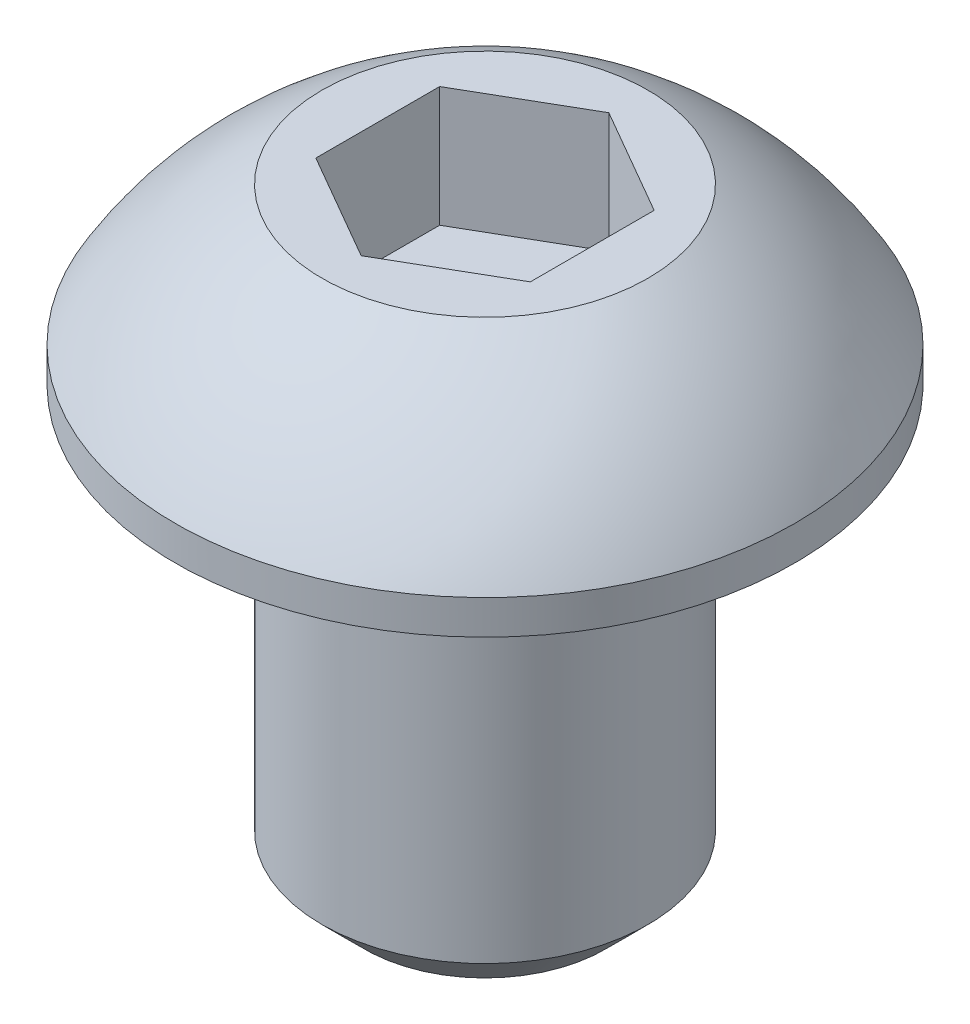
from build123d import *

# Parameters (mm, degrees)
CUT_EXTRUDE1_DEPTH = 1.778


with BuildPart() as part:
    # Sketch1 → Base-Revolve (revolve)
    with BuildSketch(Plane.XY, mode=Mode.PRIVATE) as base_revolve_sk:
        with BuildLine():
            Line((0, 0), (4.5847, 0))
            Line((4.5847, 0), (4.5847, 0.508))
            ThreePointArc((4.5847, 0.508), (3.6469405, 1.69301775), (2.413, 2.5654))
            Line((2.413, 2.5654), (0, 2.5654))
            Line((0, 2.5654), (0, 0))
        make_face()
    revolve(base_revolve_sk.sketch.rotate(Axis((0, 0, 0), (0, 1, 0)), 90), axis=Axis((0, 0, 0), (0, 1, 0)))

    # Sketch2 → Boss-Revolve1 (revolve)
    with BuildSketch(Plane.XY, mode=Mode.PRIVATE) as boss_revolve1_sk:
        Polygon((0, -6.35), (1.78308, -6.35), (2.413, -5.72008), (2.413, 0), (0, 0), align=None)
    revolve(boss_revolve1_sk.sketch.rotate(Axis((0, 0, 0), (0, 1, 0)), 90), axis=Axis((0, 0, 0), (0, 1, 0)))

    # Sketch3 → Cut-Extrude1 (cut)
    with BuildSketch(Plane(origin=(0, 2.5654, 0), x_dir=(-1, 0, 0), z_dir=(0, 1, 0))):
        Polygon((1.5875, 0.916543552), (0, 1.833087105), (-1.5875, 0.916543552), (-1.5875, -0.916543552), (0, -1.833087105), (1.5875, -0.916543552), align=None)
    extrude(amount=-CUT_EXTRUDE1_DEPTH, mode=Mode.SUBTRACT)


solid = part.part
